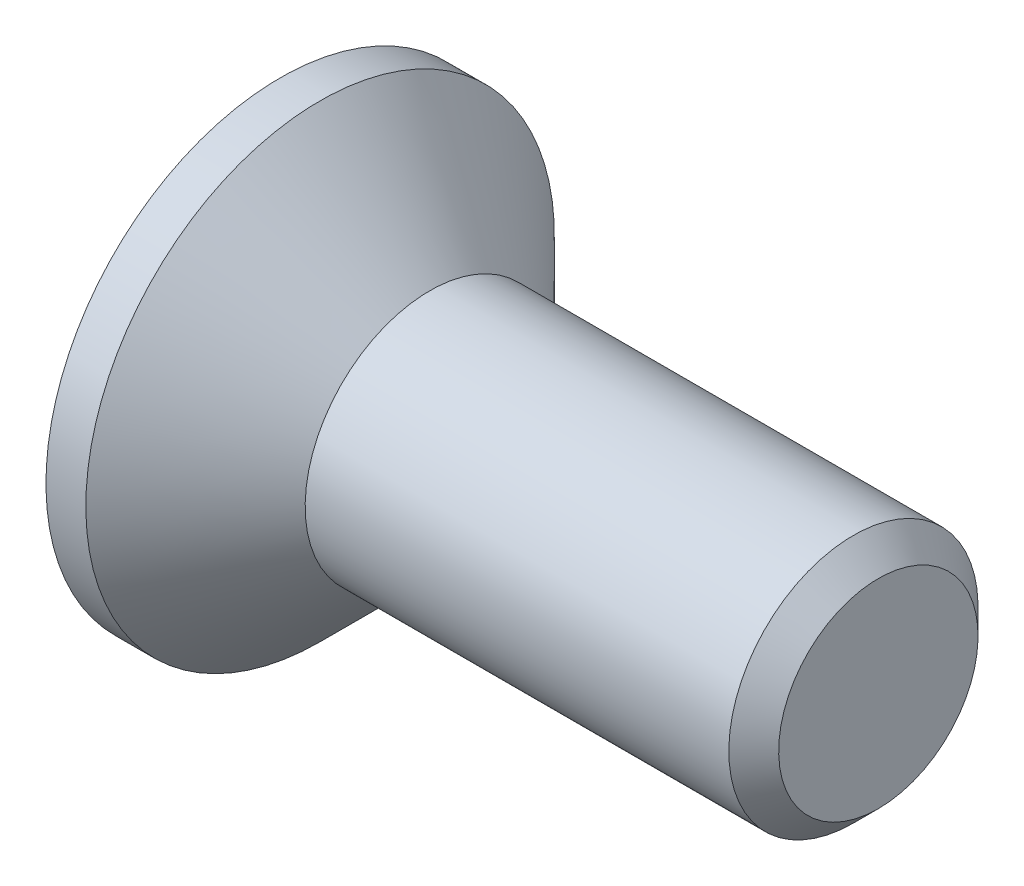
from build123d import *

# Parameters (mm, degrees)
CHAMFER1_SIZE      = 0.25
CUT_EXTRUDE1_DEPTH = 1.25


with BuildPart() as part:
    # Sketch1 → Revolve1 (revolve)
    with BuildSketch(Plane.XY, mode=Mode.PRIVATE) as revolve1_sk:
        Polygon((-1.5, 2.35), (-1.5, 0), (4.5, 0), (4.5, 1.25), (0, 1.25), (-1.1, 2.35), align=None)
    revolve(revolve1_sk.sketch.rotate(Axis((-1.5, 0, 0), (1, 0, 0)), 180), axis=Axis((-1.5, 0, 0), (1, 0, 0)))

    # Chamfer1
    chamfer1_edges = [part.edges().sort_by_distance(p)[0] for p in [
        (4.5, 1.25, 0),
    ]]
    chamfer(chamfer1_edges, length=CHAMFER1_SIZE)

    # Sketch2 → Cut-Extrude1 (cut)
    with BuildSketch(Plane.ZY.offset(1.5)):
        Polygon((-0.34, 1.35), (0.34, 1.35), (0.34, 0.34), (1.35, 0.34), (1.35, -0.34), (0.34, -0.34), (0.34, -1.35), (-0.34, -1.35), (-0.34, -0.34), (-1.35, -0.34), (-1.35, 0.34), (-0.34, 0.34), align=None)
    extrude(amount=-CUT_EXTRUDE1_DEPTH, mode=Mode.SUBTRACT)


solid = part.part
